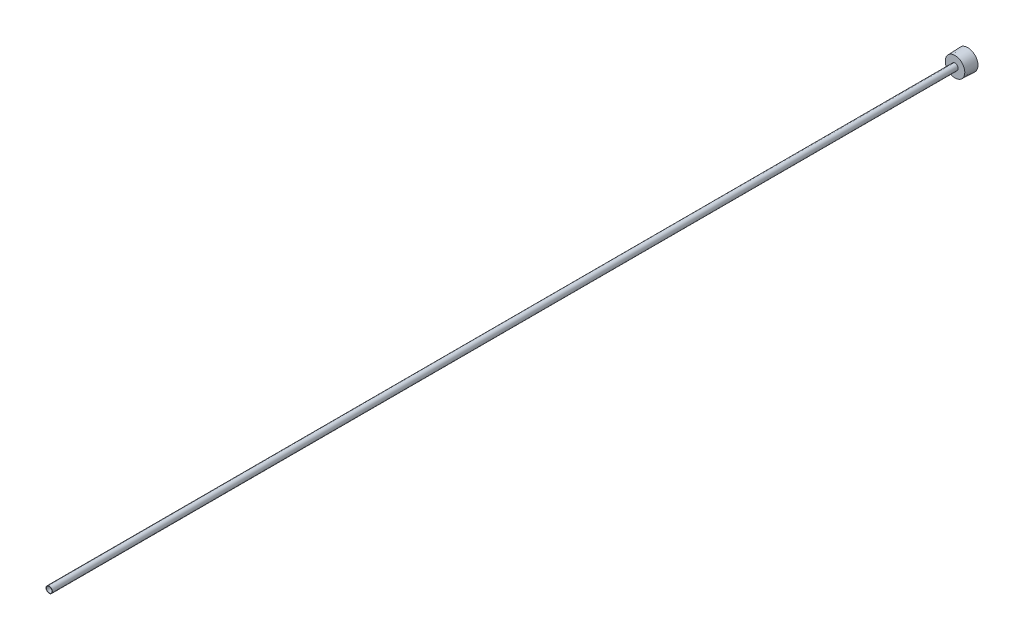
ISO-10303-21;
HEADER;
FILE_DESCRIPTION(('STEP AP214'),'2;1');
FILE_NAME('part.step','',(''),(''),'','','');
FILE_SCHEMA(('AUTOMOTIVE_DESIGN { 1 0 10303 214 1 1 1 1 }'));
ENDSEC;
DATA;
#1=APPLICATION_CONTEXT('core data for automotive mechanical design processes');
#2=APPLICATION_PROTOCOL_DEFINITION('international standard','automotive_design',2000,#1);
#3=PRODUCT_CONTEXT('',#1,'mechanical');
#4=PRODUCT('Part','Part','',(#3));
#5=PRODUCT_RELATED_PRODUCT_CATEGORY('part','',(#4));
#6=PRODUCT_DEFINITION_FORMATION('','',#4);
#7=PRODUCT_DEFINITION_CONTEXT('part definition',#1,'design');
#8=PRODUCT_DEFINITION('design','',#6,#7);
#9=PRODUCT_DEFINITION_SHAPE('','',#8);
#10=(LENGTH_UNIT() NAMED_UNIT(*) SI_UNIT(.MILLI.,.METRE.));
#11=(NAMED_UNIT(*) PLANE_ANGLE_UNIT() SI_UNIT($,.RADIAN.));
#12=(NAMED_UNIT(*) SI_UNIT($,.STERADIAN.) SOLID_ANGLE_UNIT());
#13=UNCERTAINTY_MEASURE_WITH_UNIT(LENGTH_MEASURE(1.E-05),#10,'distance_accuracy_value','');
#14=(GEOMETRIC_REPRESENTATION_CONTEXT(3) GLOBAL_UNCERTAINTY_ASSIGNED_CONTEXT((#13)) GLOBAL_UNIT_ASSIGNED_CONTEXT((#10,
#11,#12)) REPRESENTATION_CONTEXT('',''));
#15=CARTESIAN_POINT('',(0.,0.,0.));
#16=DIRECTION('',(0.,0.,1.));
#17=DIRECTION('',(1.,0.,0.));
#18=AXIS2_PLACEMENT_3D('',#15,#16,#17);
#19=CARTESIAN_POINT('',(0.,0.,0.));
#20=DIRECTION('',(0.,0.,1.));
#21=DIRECTION('',(1.,0.,0.));
#22=AXIS2_PLACEMENT_3D('',#19,#20,#21);
#23=CYLINDRICAL_SURFACE('',#22,1.3843);
#24=CARTESIAN_POINT('',(0.,0.,457.2));
#25=DIRECTION('',(0.,0.,1.));
#26=DIRECTION('',(1.,0.,0.));
#27=AXIS2_PLACEMENT_3D('',#24,#25,#26);
#28=CIRCLE('',#27,1.3843);
#29=CARTESIAN_POINT('',(1.3843,0.,457.2));
#30=VERTEX_POINT('',#29);
#31=EDGE_CURVE('E142',#30,#30,#28,.T.);
#32=ORIENTED_EDGE('',*,*,#31,.T.);
#33=EDGE_LOOP('',(#32));
#34=FACE_BOUND('',#33,.T.);
#35=CARTESIAN_POINT('',(0.,0.,4.7625));
#36=DIRECTION('',(0.,0.,-1.));
#37=DIRECTION('',(0.,1.,0.));
#38=AXIS2_PLACEMENT_3D('',#35,#36,#37);
#39=CIRCLE('',#38,1.3843);
#40=CARTESIAN_POINT('',(0.,1.38429999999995,4.7625));
#41=VERTEX_POINT('',#40);
#42=EDGE_CURVE('E37',#41,#41,#39,.F.);
#43=ORIENTED_EDGE('',*,*,#42,.F.);
#44=EDGE_LOOP('',(#43));
#45=FACE_BOUND('',#44,.T.);
#46=ADVANCED_FACE('F33',(#34,#45),#23,.F.);
#47=CARTESIAN_POINT('',(0.,0.,0.));
#48=DIRECTION('',(0.,0.,1.));
#49=DIRECTION('',(0.,-1.,0.));
#50=AXIS2_PLACEMENT_3D('',#47,#48,#49);
#51=PLANE('',#50);
#52=DIRECTION('',(-0.866025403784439,0.5,0.));
#53=VECTOR('',#52,1.);
#54=CARTESIAN_POINT('',(0.,-3.66617420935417,0.));
#55=LINE('',#54,#53);
#56=CARTESIAN_POINT('',(0.,-3.66617420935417,0.));
#57=VERTEX_POINT('',#56);
#58=CARTESIAN_POINT('',(-3.175,-1.83308710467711,0.));
#59=VERTEX_POINT('',#58);
#60=EDGE_CURVE('E124',#57,#59,#55,.T.);
#61=ORIENTED_EDGE('',*,*,#60,.F.);
#62=DIRECTION('',(-0.866025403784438,-0.500000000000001,0.));
#63=VECTOR('',#62,1.);
#64=CARTESIAN_POINT('',(3.175,-1.83308710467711,0.));
#65=LINE('',#64,#63);
#66=CARTESIAN_POINT('',(3.175,-1.83308710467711,0.));
#67=VERTEX_POINT('',#66);
#68=EDGE_CURVE('E49',#67,#57,#65,.T.);
#69=ORIENTED_EDGE('',*,*,#68,.F.);
#70=DIRECTION('',(0.,-1.,0.));
#71=VECTOR('',#70,1.);
#72=CARTESIAN_POINT('',(3.175,1.83308710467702,0.));
#73=LINE('',#72,#71);
#74=CARTESIAN_POINT('',(3.175,1.83308710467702,0.));
#75=VERTEX_POINT('',#74);
#76=EDGE_CURVE('E133',#75,#67,#73,.T.);
#77=ORIENTED_EDGE('',*,*,#76,.F.);
#78=DIRECTION('',(0.866025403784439,-0.5,0.));
#79=VECTOR('',#78,1.);
#80=CARTESIAN_POINT('',(0.,3.66617420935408,0.));
#81=LINE('',#80,#79);
#82=CARTESIAN_POINT('',(0.,3.66617420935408,0.));
#83=VERTEX_POINT('',#82);
#84=EDGE_CURVE('E131',#83,#75,#81,.T.);
#85=ORIENTED_EDGE('',*,*,#84,.F.);
#86=DIRECTION('',(0.866025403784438,0.5,0.));
#87=VECTOR('',#86,1.);
#88=CARTESIAN_POINT('',(-3.175,1.83308710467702,0.));
#89=LINE('',#88,#87);
#90=CARTESIAN_POINT('',(-3.175,1.83308710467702,0.));
#91=VERTEX_POINT('',#90);
#92=EDGE_CURVE('E97',#91,#83,#89,.T.);
#93=ORIENTED_EDGE('',*,*,#92,.F.);
#94=DIRECTION('',(0.,1.,0.));
#95=VECTOR('',#94,1.);
#96=CARTESIAN_POINT('',(-3.175,-1.83308710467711,0.));
#97=LINE('',#96,#95);
#98=EDGE_CURVE('E127',#59,#91,#97,.T.);
#99=ORIENTED_EDGE('',*,*,#98,.F.);
#100=EDGE_LOOP('',(#61,#69,#77,#85,#93,#99));
#101=FACE_BOUND('',#100,.T.);
#102=CARTESIAN_POINT('',(0.,0.,0.));
#103=DIRECTION('',(0.,0.,1.));
#104=DIRECTION('',(0.,-1.,0.));
#105=AXIS2_PLACEMENT_3D('',#102,#103,#104);
#106=CIRCLE('',#105,5.09270000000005);
#107=CARTESIAN_POINT('',(0.,-5.09270000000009,0.));
#108=VERTEX_POINT('',#107);
#109=EDGE_CURVE('E11',#108,#108,#106,.T.);
#110=ORIENTED_EDGE('',*,*,#109,.F.);
#111=EDGE_LOOP('',(#110));
#112=FACE_BOUND('',#111,.T.);
#113=ADVANCED_FACE('F35',(#101,#112),#51,.F.);
#114=CARTESIAN_POINT('',(0.,0.,0.));
#115=DIRECTION('',(0.,0.,-1.));
#116=DIRECTION('',(0.,1.,0.));
#117=AXIS2_PLACEMENT_3D('',#114,#115,#116);
#118=CONICAL_SURFACE('',#117,5.09270000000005,0.0364599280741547);
#119=CARTESIAN_POINT('',(0.,0.,6.35));
#120=DIRECTION('',(0.,0.,1.));
#121=DIRECTION('',(0.,-1.,0.));
#122=AXIS2_PLACEMENT_3D('',#119,#120,#121);
#123=CIRCLE('',#122,4.86107681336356);
#124=CARTESIAN_POINT('',(0.,-4.86107681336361,6.35));
#125=VERTEX_POINT('',#124);
#126=EDGE_CURVE('E42',#125,#125,#123,.T.);
#127=ORIENTED_EDGE('',*,*,#126,.F.);
#128=EDGE_LOOP('',(#127));
#129=FACE_BOUND('',#128,.T.);
#130=ORIENTED_EDGE('',*,*,#109,.T.);
#131=EDGE_LOOP('',(#130));
#132=FACE_BOUND('',#131,.T.);
#133=ADVANCED_FACE('F156',(#129,#132),#118,.T.);
#134=CARTESIAN_POINT('',(0.,4.86107681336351,6.35));
#135=DIRECTION('',(0.,0.,-1.));
#136=DIRECTION('',(0.,1.,0.));
#137=AXIS2_PLACEMENT_3D('',#134,#135,#136);
#138=PLANE('',#137);
#139=CARTESIAN_POINT('',(0.,0.,6.35));
#140=DIRECTION('',(0.,0.,1.));
#141=DIRECTION('',(0.,-1.,0.));
#142=AXIS2_PLACEMENT_3D('',#139,#140,#141);
#143=CIRCLE('',#142,1.58750000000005);
#144=CARTESIAN_POINT('',(0.,-1.58750000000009,6.35));
#145=VERTEX_POINT('',#144);
#146=EDGE_CURVE('E148',#145,#145,#143,.T.);
#147=ORIENTED_EDGE('',*,*,#146,.F.);
#148=EDGE_LOOP('',(#147));
#149=FACE_BOUND('',#148,.T.);
#150=ORIENTED_EDGE('',*,*,#126,.T.);
#151=EDGE_LOOP('',(#150));
#152=FACE_BOUND('',#151,.T.);
#153=ADVANCED_FACE('F154',(#149,#152),#138,.F.);
#154=CARTESIAN_POINT('',(0.,0.,0.));
#155=DIRECTION('',(0.,0.,1.));
#156=DIRECTION('',(0.,-1.,0.));
#157=AXIS2_PLACEMENT_3D('',#154,#155,#156);
#158=CYLINDRICAL_SURFACE('',#157,1.58750000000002);
#159=CARTESIAN_POINT('',(0.,0.,457.2));
#160=DIRECTION('',(0.,0.,1.));
#161=DIRECTION('',(0.,-1.,0.));
#162=AXIS2_PLACEMENT_3D('',#159,#160,#161);
#163=CIRCLE('',#162,1.58749999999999);
#164=CARTESIAN_POINT('',(0.,-1.58750000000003,457.2));
#165=VERTEX_POINT('',#164);
#166=EDGE_CURVE('E145',#165,#165,#163,.T.);
#167=ORIENTED_EDGE('',*,*,#166,.F.);
#168=EDGE_LOOP('',(#167));
#169=FACE_BOUND('',#168,.T.);
#170=ORIENTED_EDGE('',*,*,#146,.T.);
#171=EDGE_LOOP('',(#170));
#172=FACE_BOUND('',#171,.T.);
#173=ADVANCED_FACE('F190',(#169,#172),#158,.T.);
#174=CARTESIAN_POINT('',(0.,1.58749999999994,457.2));
#175=DIRECTION('',(0.,0.,-1.));
#176=DIRECTION('',(0.,1.,0.));
#177=AXIS2_PLACEMENT_3D('',#174,#175,#176);
#178=PLANE('',#177);
#179=ORIENTED_EDGE('',*,*,#31,.F.);
#180=EDGE_LOOP('',(#179));
#181=FACE_BOUND('',#180,.T.);
#182=ORIENTED_EDGE('',*,*,#166,.T.);
#183=EDGE_LOOP('',(#182));
#184=FACE_BOUND('',#183,.T.);
#185=ADVANCED_FACE('F183',(#181,#184),#178,.F.);
#186=CARTESIAN_POINT('',(0.,-3.66617420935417,4.7625));
#187=DIRECTION('',(0.,0.,-1.));
#188=DIRECTION('',(0.,1.,0.));
#189=AXIS2_PLACEMENT_3D('',#186,#187,#188);
#190=PLANE('',#189);
#191=DIRECTION('',(-0.866025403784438,-0.500000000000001,0.));
#192=VECTOR('',#191,1.);
#193=CARTESIAN_POINT('',(3.175,-1.83308710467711,4.7625));
#194=LINE('',#193,#192);
#195=CARTESIAN_POINT('',(3.175,-1.83308710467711,4.7625));
#196=VERTEX_POINT('',#195);
#197=CARTESIAN_POINT('',(0.,-3.66617420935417,4.7625));
#198=VERTEX_POINT('',#197);
#199=EDGE_CURVE('E135',#196,#198,#194,.T.);
#200=ORIENTED_EDGE('',*,*,#199,.T.);
#201=DIRECTION('',(-0.866025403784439,0.5,0.));
#202=VECTOR('',#201,1.);
#203=CARTESIAN_POINT('',(0.,-3.66617420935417,4.7625));
#204=LINE('',#203,#202);
#205=CARTESIAN_POINT('',(-3.175,-1.83308710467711,4.7625));
#206=VERTEX_POINT('',#205);
#207=EDGE_CURVE('E118',#198,#206,#204,.T.);
#208=ORIENTED_EDGE('',*,*,#207,.T.);
#209=DIRECTION('',(0.,1.,0.));
#210=VECTOR('',#209,1.);
#211=CARTESIAN_POINT('',(-3.175,-1.83308710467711,4.7625));
#212=LINE('',#211,#210);
#213=CARTESIAN_POINT('',(-3.175,1.83308710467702,4.7625));
#214=VERTEX_POINT('',#213);
#215=EDGE_CURVE('E116',#206,#214,#212,.T.);
#216=ORIENTED_EDGE('',*,*,#215,.T.);
#217=DIRECTION('',(0.866025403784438,0.5,0.));
#218=VECTOR('',#217,1.);
#219=CARTESIAN_POINT('',(-3.175,1.83308710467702,4.7625));
#220=LINE('',#219,#218);
#221=CARTESIAN_POINT('',(0.,3.66617420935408,4.7625));
#222=VERTEX_POINT('',#221);
#223=EDGE_CURVE('E94',#214,#222,#220,.T.);
#224=ORIENTED_EDGE('',*,*,#223,.T.);
#225=DIRECTION('',(0.866025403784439,-0.5,0.));
#226=VECTOR('',#225,1.);
#227=CARTESIAN_POINT('',(0.,3.66617420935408,4.7625));
#228=LINE('',#227,#226);
#229=CARTESIAN_POINT('',(3.175,1.83308710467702,4.7625));
#230=VERTEX_POINT('',#229);
#231=EDGE_CURVE('E105',#222,#230,#228,.T.);
#232=ORIENTED_EDGE('',*,*,#231,.T.);
#233=DIRECTION('',(0.,-1.,0.));
#234=VECTOR('',#233,1.);
#235=CARTESIAN_POINT('',(3.175,1.83308710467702,4.7625));
#236=LINE('',#235,#234);
#237=EDGE_CURVE('E109',#230,#196,#236,.T.);
#238=ORIENTED_EDGE('',*,*,#237,.T.);
#239=EDGE_LOOP('',(#200,#208,#216,#224,#232,#238));
#240=FACE_BOUND('',#239,.T.);
#241=ORIENTED_EDGE('',*,*,#42,.T.);
#242=EDGE_LOOP('',(#241));
#243=FACE_BOUND('',#242,.T.);
#244=ADVANCED_FACE('F112',(#240,#243),#190,.T.);
#245=CARTESIAN_POINT('',(3.175,-1.83308710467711,4.7625));
#246=DIRECTION('',(0.5,-0.866025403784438,0.));
#247=DIRECTION('',(0.866025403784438,0.5,0.));
#248=AXIS2_PLACEMENT_3D('',#245,#246,#247);
#249=PLANE('',#248);
#250=ORIENTED_EDGE('',*,*,#68,.T.);
#251=DIRECTION('',(0.,0.,-1.));
#252=VECTOR('',#251,1.);
#253=CARTESIAN_POINT('',(0.,-3.66617420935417,4.7625));
#254=LINE('',#253,#252);
#255=EDGE_CURVE('E79',#198,#57,#254,.T.);
#256=ORIENTED_EDGE('',*,*,#255,.F.);
#257=ORIENTED_EDGE('',*,*,#199,.F.);
#258=DIRECTION('',(0.,0.,-1.));
#259=VECTOR('',#258,1.);
#260=CARTESIAN_POINT('',(3.175,-1.83308710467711,4.7625));
#261=LINE('',#260,#259);
#262=EDGE_CURVE('E57',#196,#67,#261,.T.);
#263=ORIENTED_EDGE('',*,*,#262,.T.);
#264=EDGE_LOOP('',(#250,#256,#257,#263));
#265=FACE_BOUND('',#264,.T.);
#266=ADVANCED_FACE('F174',(#265),#249,.F.);
#267=CARTESIAN_POINT('',(3.175,1.83308710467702,4.7625));
#268=DIRECTION('',(1.,0.,0.));
#269=DIRECTION('',(0.,1.,0.));
#270=AXIS2_PLACEMENT_3D('',#267,#268,#269);
#271=PLANE('',#270);
#272=ORIENTED_EDGE('',*,*,#76,.T.);
#273=ORIENTED_EDGE('',*,*,#262,.F.);
#274=ORIENTED_EDGE('',*,*,#237,.F.);
#275=DIRECTION('',(0.,0.,-1.));
#276=VECTOR('',#275,1.);
#277=CARTESIAN_POINT('',(3.175,1.83308710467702,4.7625));
#278=LINE('',#277,#276);
#279=EDGE_CURVE('E101',#230,#75,#278,.T.);
#280=ORIENTED_EDGE('',*,*,#279,.T.);
#281=EDGE_LOOP('',(#272,#273,#274,#280));
#282=FACE_BOUND('',#281,.T.);
#283=ADVANCED_FACE('F176',(#282),#271,.F.);
#284=CARTESIAN_POINT('',(0.,3.66617420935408,4.7625));
#285=DIRECTION('',(0.5,0.866025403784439,0.));
#286=DIRECTION('',(-0.866025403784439,0.5,0.));
#287=AXIS2_PLACEMENT_3D('',#284,#285,#286);
#288=PLANE('',#287);
#289=ORIENTED_EDGE('',*,*,#84,.T.);
#290=ORIENTED_EDGE('',*,*,#279,.F.);
#291=ORIENTED_EDGE('',*,*,#231,.F.);
#292=DIRECTION('',(0.,0.,-1.));
#293=VECTOR('',#292,1.);
#294=CARTESIAN_POINT('',(0.,3.66617420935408,4.7625));
#295=LINE('',#294,#293);
#296=EDGE_CURVE('E90',#222,#83,#295,.T.);
#297=ORIENTED_EDGE('',*,*,#296,.T.);
#298=EDGE_LOOP('',(#289,#290,#291,#297));
#299=FACE_BOUND('',#298,.T.);
#300=ADVANCED_FACE('F106',(#299),#288,.F.);
#301=CARTESIAN_POINT('',(-3.175,1.83308710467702,4.7625));
#302=DIRECTION('',(-0.5,0.866025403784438,0.));
#303=DIRECTION('',(-0.866025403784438,-0.5,0.));
#304=AXIS2_PLACEMENT_3D('',#301,#302,#303);
#305=PLANE('',#304);
#306=ORIENTED_EDGE('',*,*,#92,.T.);
#307=ORIENTED_EDGE('',*,*,#296,.F.);
#308=ORIENTED_EDGE('',*,*,#223,.F.);
#309=DIRECTION('',(0.,0.,-1.));
#310=VECTOR('',#309,1.);
#311=CARTESIAN_POINT('',(-3.175,1.83308710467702,4.7625));
#312=LINE('',#311,#310);
#313=EDGE_CURVE('E102',#214,#91,#312,.T.);
#314=ORIENTED_EDGE('',*,*,#313,.T.);
#315=EDGE_LOOP('',(#306,#307,#308,#314));
#316=FACE_BOUND('',#315,.T.);
#317=ADVANCED_FACE('F92',(#316),#305,.F.);
#318=CARTESIAN_POINT('',(-3.175,-1.83308710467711,4.7625));
#319=DIRECTION('',(-1.,0.,0.));
#320=DIRECTION('',(0.,-1.,0.));
#321=AXIS2_PLACEMENT_3D('',#318,#319,#320);
#322=PLANE('',#321);
#323=ORIENTED_EDGE('',*,*,#98,.T.);
#324=ORIENTED_EDGE('',*,*,#313,.F.);
#325=ORIENTED_EDGE('',*,*,#215,.F.);
#326=DIRECTION('',(0.,0.,-1.));
#327=VECTOR('',#326,1.);
#328=CARTESIAN_POINT('',(-3.175,-1.83308710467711,4.7625));
#329=LINE('',#328,#327);
#330=EDGE_CURVE('E139',#206,#59,#329,.T.);
#331=ORIENTED_EDGE('',*,*,#330,.T.);
#332=EDGE_LOOP('',(#323,#324,#325,#331));
#333=FACE_BOUND('',#332,.T.);
#334=ADVANCED_FACE('F246',(#333),#322,.F.);
#335=CARTESIAN_POINT('',(0.,-3.66617420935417,4.7625));
#336=DIRECTION('',(-0.5,-0.866025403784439,0.));
#337=DIRECTION('',(0.866025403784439,-0.5,0.));
#338=AXIS2_PLACEMENT_3D('',#335,#336,#337);
#339=PLANE('',#338);
#340=ORIENTED_EDGE('',*,*,#60,.T.);
#341=ORIENTED_EDGE('',*,*,#330,.F.);
#342=ORIENTED_EDGE('',*,*,#207,.F.);
#343=ORIENTED_EDGE('',*,*,#255,.T.);
#344=EDGE_LOOP('',(#340,#341,#342,#343));
#345=FACE_BOUND('',#344,.T.);
#346=ADVANCED_FACE('F172',(#345),#339,.F.);
#347=CLOSED_SHELL('',(#46,#113,#133,#153,#173,#185,#244,#266,#283,#300,#317,#334,#346));
#348=MANIFOLD_SOLID_BREP('B2',#347);
#349=ADVANCED_BREP_SHAPE_REPRESENTATION('',(#18,#348),#14);
#350=SHAPE_DEFINITION_REPRESENTATION(#9,#349);
ENDSEC;
END-ISO-10303-21;
